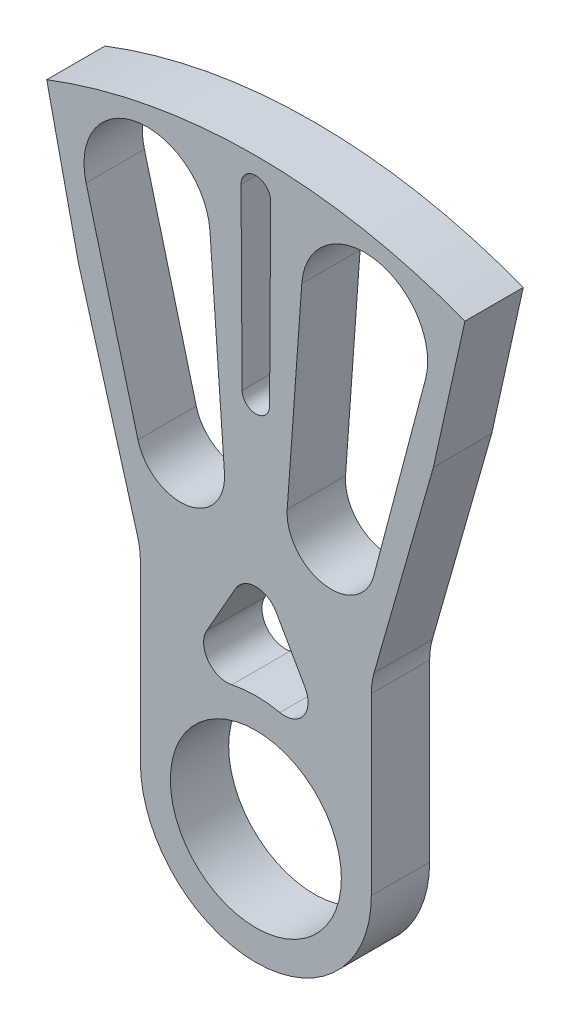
ISO-10303-21;
HEADER;
FILE_DESCRIPTION(('STEP AP214'),'2;1');
FILE_NAME('part.step','',(''),(''),'','','');
FILE_SCHEMA(('AUTOMOTIVE_DESIGN { 1 0 10303 214 1 1 1 1 }'));
ENDSEC;
DATA;
#1=APPLICATION_CONTEXT('core data for automotive mechanical design processes');
#2=APPLICATION_PROTOCOL_DEFINITION('international standard','automotive_design',2000,#1);
#3=PRODUCT_CONTEXT('',#1,'mechanical');
#4=PRODUCT('Part','Part','',(#3));
#5=PRODUCT_RELATED_PRODUCT_CATEGORY('part','',(#4));
#6=PRODUCT_DEFINITION_FORMATION('','',#4);
#7=PRODUCT_DEFINITION_CONTEXT('part definition',#1,'design');
#8=PRODUCT_DEFINITION('design','',#6,#7);
#9=PRODUCT_DEFINITION_SHAPE('','',#8);
#10=(LENGTH_UNIT() NAMED_UNIT(*) SI_UNIT(.MILLI.,.METRE.));
#11=(NAMED_UNIT(*) PLANE_ANGLE_UNIT() SI_UNIT($,.RADIAN.));
#12=(NAMED_UNIT(*) SI_UNIT($,.STERADIAN.) SOLID_ANGLE_UNIT());
#13=UNCERTAINTY_MEASURE_WITH_UNIT(LENGTH_MEASURE(1.E-05),#10,'distance_accuracy_value','');
#14=(GEOMETRIC_REPRESENTATION_CONTEXT(3) GLOBAL_UNCERTAINTY_ASSIGNED_CONTEXT((#13)) GLOBAL_UNIT_ASSIGNED_CONTEXT((#10,
#11,#12)) REPRESENTATION_CONTEXT('',''));
#15=CARTESIAN_POINT('',(0.,0.,0.));
#16=DIRECTION('',(0.,0.,1.));
#17=DIRECTION('',(1.,0.,0.));
#18=AXIS2_PLACEMENT_3D('',#15,#16,#17);
#19=CARTESIAN_POINT('',(0.,0.,-3.175));
#20=DIRECTION('',(0.,0.,1.));
#21=DIRECTION('',(1.,0.,0.));
#22=AXIS2_PLACEMENT_3D('',#19,#20,#21);
#23=PLANE('',#22);
#24=CARTESIAN_POINT('',(8.19902896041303,31.5104751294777,-3.175));
#25=DIRECTION('',(0.,0.,1.));
#26=DIRECTION('',(1.,0.,0.));
#27=AXIS2_PLACEMENT_3D('',#24,#25,#26);
#28=CIRCLE('',#27,4.79599679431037);
#29=CARTESIAN_POINT('',(6.06143658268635,27.217191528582,-3.175));
#30=VERTEX_POINT('',#29);
#31=CARTESIAN_POINT('',(12.8362883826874,30.2867879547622,-3.175));
#32=VERTEX_POINT('',#31);
#33=EDGE_CURVE('E11',#30,#32,#28,.T.);
#34=ORIENTED_EDGE('',*,*,#33,.T.);
#35=DIRECTION('',(0.255147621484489,0.966902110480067,0.));
#36=VECTOR('',#35,1.);
#37=CARTESIAN_POINT('',(18.4823558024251,51.6830074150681,-3.175));
#38=LINE('',#37,#36);
#39=CARTESIAN_POINT('',(14.4922875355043,36.5623278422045,-3.175));
#40=VERTEX_POINT('',#39);
#41=EDGE_CURVE('E370',#32,#40,#38,.T.);
#42=ORIENTED_EDGE('',*,*,#41,.T.);
#43=CARTESIAN_POINT('',(9.64692436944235,32.4580671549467,-3.175));
#44=DIRECTION('',(0.,0.,1.));
#45=DIRECTION('',(1.,0.,0.));
#46=AXIS2_PLACEMENT_3D('',#43,#44,#45);
#47=CIRCLE('',#46,6.35);
#48=CARTESIAN_POINT('',(15.9844545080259,32.060308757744,-3.175));
#49=VERTEX_POINT('',#48);
#50=EDGE_CURVE('E477',#40,#49,#47,.F.);
#51=ORIENTED_EDGE('',*,*,#50,.T.);
#52=DIRECTION('',(-0.27465134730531,-0.961543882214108,0.));
#53=VECTOR('',#52,1.);
#54=CARTESIAN_POINT('',(12.8660356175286,21.1428432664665,-3.175));
#55=LINE('',#54,#53);
#56=CARTESIAN_POINT('',(15.2384195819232,29.4484689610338,-3.175));
#57=VERTEX_POINT('',#56);
#58=EDGE_CURVE('E420',#49,#57,#55,.T.);
#59=ORIENTED_EDGE('',*,*,#58,.T.);
#60=EDGE_CURVE('E478',#57,#30,#47,.F.);
#61=ORIENTED_EDGE('',*,*,#60,.T.);
#62=EDGE_LOOP('',(#34,#42,#51,#59,#61));
#63=FACE_BOUND('',#62,.T.);
#64=ADVANCED_FACE('F38',(#63),#23,.F.);
#65=CARTESIAN_POINT('',(0.,0.,-3.175));
#66=DIRECTION('',(0.,0.,-1.));
#67=DIRECTION('',(1.,0.,0.));
#68=AXIS2_PLACEMENT_3D('',#65,#66,#67);
#69=CIRCLE('',#68,12.5730000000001);
#70=CARTESIAN_POINT('',(-2.61578959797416,12.2978849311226,-3.175));
#71=VERTEX_POINT('',#70);
#72=CARTESIAN_POINT('',(2.61578959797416,12.2978849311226,-3.175));
#73=VERTEX_POINT('',#72);
#74=EDGE_CURVE('E249',#71,#73,#69,.T.);
#75=ORIENTED_EDGE('',*,*,#74,.T.);
#76=CARTESIAN_POINT('',(3.14423194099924,14.7823061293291,-3.175));
#77=DIRECTION('',(0.,0.,1.));
#78=DIRECTION('',(-1.,0.,0.));
#79=AXIS2_PLACEMENT_3D('',#76,#77,#78);
#80=CIRCLE('',#79,2.54);
#81=CARTESIAN_POINT('',(5.35302583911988,16.0364311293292,-3.175));
#82=VERTEX_POINT('',#81);
#83=EDGE_CURVE('E243',#73,#82,#80,.T.);
#84=ORIENTED_EDGE('',*,*,#83,.T.);
#85=DIRECTION('',(-0.493750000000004,0.86960389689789,0.));
#86=VECTOR('',#85,1.);
#87=CARTESIAN_POINT('',(2.20879389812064,21.574125,-3.175));
#88=LINE('',#87,#86);
#89=CARTESIAN_POINT('',(2.20879389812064,21.574125,-3.175));
#90=VERTEX_POINT('',#89);
#91=EDGE_CURVE('E252',#82,#90,#88,.T.);
#92=ORIENTED_EDGE('',*,*,#91,.T.);
#93=CARTESIAN_POINT('',(0.,20.32,-3.175));
#94=DIRECTION('',(0.,0.,1.));
#95=DIRECTION('',(-1.,0.,0.));
#96=AXIS2_PLACEMENT_3D('',#93,#94,#95);
#97=CIRCLE('',#96,2.54);
#98=CARTESIAN_POINT('',(-2.20879389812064,21.574125,-3.175));
#99=VERTEX_POINT('',#98);
#100=EDGE_CURVE('E53',#90,#99,#97,.T.);
#101=ORIENTED_EDGE('',*,*,#100,.T.);
#102=DIRECTION('',(-0.493750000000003,-0.86960389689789,0.));
#103=VECTOR('',#102,1.);
#104=CARTESIAN_POINT('',(-5.35302583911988,16.0364311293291,-3.175));
#105=LINE('',#104,#103);
#106=CARTESIAN_POINT('',(-5.35302583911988,16.0364311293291,-3.175));
#107=VERTEX_POINT('',#106);
#108=EDGE_CURVE('E267',#99,#107,#105,.T.);
#109=ORIENTED_EDGE('',*,*,#108,.T.);
#110=CARTESIAN_POINT('',(-3.14423194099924,14.7823061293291,-3.175));
#111=DIRECTION('',(0.,0.,1.));
#112=DIRECTION('',(1.,0.,0.));
#113=AXIS2_PLACEMENT_3D('',#110,#111,#112);
#114=CIRCLE('',#113,2.54);
#115=EDGE_CURVE('E270',#107,#71,#114,.T.);
#116=ORIENTED_EDGE('',*,*,#115,.T.);
#117=EDGE_LOOP('',(#75,#84,#92,#101,#109,#116));
#118=FACE_BOUND('',#117,.T.);
#119=DIRECTION('',(0.00604847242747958,-0.999981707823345,0.));
#120=VECTOR('',#119,1.);
#121=CARTESIAN_POINT('',(-1.49582820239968,40.6309523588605,-3.175));
#122=LINE('',#121,#120);
#123=CARTESIAN_POINT('',(-1.61296925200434,59.9976450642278,-3.175));
#124=VERTEX_POINT('',#123);
#125=CARTESIAN_POINT('',(-1.49582820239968,40.6309523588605,-3.175));
#126=VERTEX_POINT('',#125);
#127=EDGE_CURVE('E304',#124,#126,#122,.T.);
#128=ORIENTED_EDGE('',*,*,#127,.T.);
#129=CARTESIAN_POINT('',(0.,40.64,-3.175));
#130=DIRECTION('',(0.,0.,1.));
#131=DIRECTION('',(1.,0.,0.));
#132=AXIS2_PLACEMENT_3D('',#129,#130,#131);
#133=CIRCLE('',#132,1.49585556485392);
#134=CARTESIAN_POINT('',(1.49582820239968,40.6309523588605,-3.175));
#135=VERTEX_POINT('',#134);
#136=EDGE_CURVE('E294',#126,#135,#133,.T.);
#137=ORIENTED_EDGE('',*,*,#136,.T.);
#138=DIRECTION('',(0.00604847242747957,0.999981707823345,0.));
#139=VECTOR('',#138,1.);
#140=CARTESIAN_POINT('',(1.49582820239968,40.6309523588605,-3.175));
#141=LINE('',#140,#139);
#142=CARTESIAN_POINT('',(1.61296925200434,59.9976450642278,-3.175));
#143=VERTEX_POINT('',#142);
#144=EDGE_CURVE('E297',#135,#143,#141,.T.);
#145=ORIENTED_EDGE('',*,*,#144,.T.);
#146=CARTESIAN_POINT('',(0.,60.0074012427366,-3.175));
#147=DIRECTION('',(0.,0.,1.));
#148=DIRECTION('',(1.,0.,0.));
#149=AXIS2_PLACEMENT_3D('',#146,#147,#148);
#150=CIRCLE('',#149,1.61299875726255);
#151=EDGE_CURVE('E301',#143,#124,#150,.T.);
#152=ORIENTED_EDGE('',*,*,#151,.T.);
#153=EDGE_LOOP('',(#128,#137,#145,#152));
#154=FACE_BOUND('',#153,.T.);
#155=DIRECTION('',(0.255147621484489,-0.966902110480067,0.));
#156=VECTOR('',#155,1.);
#157=CARTESIAN_POINT('',(-18.4823558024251,51.6830074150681,-3.175));
#158=LINE('',#157,#156);
#159=CARTESIAN_POINT('',(-18.4823558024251,51.6830074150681,-3.175));
#160=VERTEX_POINT('',#159);
#161=CARTESIAN_POINT('',(-12.8362883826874,30.2867879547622,-3.175));
#162=VERTEX_POINT('',#161);
#163=EDGE_CURVE('E336',#160,#162,#158,.T.);
#164=ORIENTED_EDGE('',*,*,#163,.T.);
#165=CARTESIAN_POINT('',(-8.19902896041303,31.5104751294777,-3.175));
#166=DIRECTION('',(0.,0.,1.));
#167=DIRECTION('',(1.,0.,0.));
#168=AXIS2_PLACEMENT_3D('',#165,#166,#167);
#169=CIRCLE('',#168,4.79599679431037);
#170=CARTESIAN_POINT('',(-3.41534921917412,31.8539767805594,-3.175));
#171=VERTEX_POINT('',#170);
#172=EDGE_CURVE('E326',#162,#171,#169,.T.);
#173=ORIENTED_EDGE('',*,*,#172,.T.);
#174=DIRECTION('',(-0.0716225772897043,0.997431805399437,0.));
#175=VECTOR('',#174,1.);
#176=CARTESIAN_POINT('',(-5.00025876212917,53.9257765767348,-3.175));
#177=LINE('',#176,#175);
#178=CARTESIAN_POINT('',(-5.00025876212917,53.9257765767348,-3.175));
#179=VERTEX_POINT('',#178);
#180=EDGE_CURVE('E329',#171,#179,#177,.T.);
#181=ORIENTED_EDGE('',*,*,#180,.T.);
#182=CARTESIAN_POINT('',(-11.8460767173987,53.4341989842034,-3.175));
#183=DIRECTION('',(0.,0.,1.));
#184=DIRECTION('',(1.,0.,0.));
#185=AXIS2_PLACEMENT_3D('',#182,#183,#184);
#186=CIRCLE('',#185,6.86344461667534);
#187=EDGE_CURVE('E333',#179,#160,#186,.T.);
#188=ORIENTED_EDGE('',*,*,#187,.T.);
#189=EDGE_LOOP('',(#164,#173,#181,#188));
#190=FACE_BOUND('',#189,.T.);
#191=CARTESIAN_POINT('',(3.4090677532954,31.2699405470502,-3.175));
#192=VERTEX_POINT('',#191);
#193=CARTESIAN_POINT('',(3.5973103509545,34.3880076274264,-3.175));
#194=VERTEX_POINT('',#193);
#195=EDGE_CURVE('E481',#192,#194,#47,.F.);
#196=ORIENTED_EDGE('',*,*,#195,.F.);
#197=CARTESIAN_POINT('',(8.19902896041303,31.5104751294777,-3.175));
#198=DIRECTION('',(0.,0.,1.));
#199=DIRECTION('',(1.,0.,0.));
#200=AXIS2_PLACEMENT_3D('',#197,#198,#199);
#201=CIRCLE('',#200,4.79599679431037);
#202=EDGE_CURVE('E365',#192,#30,#201,.T.);
#203=ORIENTED_EDGE('',*,*,#202,.T.);
#204=ORIENTED_EDGE('',*,*,#60,.F.);
#205=CARTESIAN_POINT('',(12.8660356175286,21.1428432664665,-3.175));
#206=VERTEX_POINT('',#205);
#207=EDGE_CURVE('E414',#57,#206,#55,.T.);
#208=ORIENTED_EDGE('',*,*,#207,.T.);
#209=CARTESIAN_POINT('',(20.1930000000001,19.05,-3.175));
#210=DIRECTION('',(0.,0.,1.));
#211=DIRECTION('',(1.,0.,0.));
#212=AXIS2_PLACEMENT_3D('',#209,#210,#211);
#213=CIRCLE('',#212,7.62);
#214=CARTESIAN_POINT('',(12.5730000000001,19.05,-3.175));
#215=VERTEX_POINT('',#214);
#216=EDGE_CURVE('E411',#206,#215,#213,.T.);
#217=ORIENTED_EDGE('',*,*,#216,.T.);
#218=DIRECTION('',(0.,1.,0.));
#219=VECTOR('',#218,1.);
#220=CARTESIAN_POINT('',(12.5730000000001,13.2922511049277,-3.175));
#221=LINE('',#220,#219);
#222=CARTESIAN_POINT('',(12.5730000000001,0.,-3.175));
#223=VERTEX_POINT('',#222);
#224=EDGE_CURVE('E456',#223,#215,#221,.T.);
#225=ORIENTED_EDGE('',*,*,#224,.F.);
#226=CARTESIAN_POINT('',(0.,0.,-3.175));
#227=DIRECTION('',(0.,0.,1.));
#228=DIRECTION('',(1.,0.,0.));
#229=AXIS2_PLACEMENT_3D('',#226,#227,#228);
#230=CIRCLE('',#229,12.5730000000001);
#231=CARTESIAN_POINT('',(-12.573,0.,-3.175));
#232=VERTEX_POINT('',#231);
#233=EDGE_CURVE('E437',#232,#223,#230,.T.);
#234=ORIENTED_EDGE('',*,*,#233,.F.);
#235=DIRECTION('',(0.,-1.,0.));
#236=VECTOR('',#235,1.);
#237=CARTESIAN_POINT('',(-12.5730000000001,13.2922511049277,-3.175));
#238=LINE('',#237,#236);
#239=CARTESIAN_POINT('',(-12.5730000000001,19.05,-3.175));
#240=VERTEX_POINT('',#239);
#241=EDGE_CURVE('E442',#240,#232,#238,.T.);
#242=ORIENTED_EDGE('',*,*,#241,.F.);
#243=CARTESIAN_POINT('',(-20.1930000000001,19.05,-3.175));
#244=DIRECTION('',(0.,0.,1.));
#245=DIRECTION('',(-1.,0.,0.));
#246=AXIS2_PLACEMENT_3D('',#243,#244,#245);
#247=CIRCLE('',#246,7.62);
#248=CARTESIAN_POINT('',(-12.8660356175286,21.1428432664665,-3.175));
#249=VERTEX_POINT('',#248);
#250=EDGE_CURVE('E392',#240,#249,#247,.T.);
#251=ORIENTED_EDGE('',*,*,#250,.T.);
#252=DIRECTION('',(-0.27465134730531,0.961543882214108,0.));
#253=VECTOR('',#252,1.);
#254=CARTESIAN_POINT('',(-12.8660356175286,21.1428432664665,-3.175));
#255=LINE('',#254,#253);
#256=CARTESIAN_POINT('',(-19.3318097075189,43.7792715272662,-3.175));
#257=VERTEX_POINT('',#256);
#258=EDGE_CURVE('E395',#249,#257,#255,.T.);
#259=ORIENTED_EDGE('',*,*,#258,.T.);
#260=DIRECTION('',(0.216439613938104,-0.976296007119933,0.));
#261=VECTOR('',#260,1.);
#262=CARTESIAN_POINT('',(-22.7677885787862,59.2779706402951,-3.175));
#263=LINE('',#262,#261);
#264=CARTESIAN_POINT('',(-22.7677885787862,59.2779706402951,-3.175));
#265=VERTEX_POINT('',#264);
#266=EDGE_CURVE('E462',#265,#257,#263,.T.);
#267=ORIENTED_EDGE('',*,*,#266,.F.);
#268=CARTESIAN_POINT('',(0.,0.,-3.175));
#269=DIRECTION('',(0.,0.,1.));
#270=DIRECTION('',(1.,0.,0.));
#271=AXIS2_PLACEMENT_3D('',#268,#269,#270);
#272=CIRCLE('',#271,63.5);
#273=CARTESIAN_POINT('',(22.7677885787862,59.2779706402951,-3.175));
#274=VERTEX_POINT('',#273);
#275=EDGE_CURVE('E460',#274,#265,#272,.T.);
#276=ORIENTED_EDGE('',*,*,#275,.F.);
#277=DIRECTION('',(0.216439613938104,0.976296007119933,0.));
#278=VECTOR('',#277,1.);
#279=CARTESIAN_POINT('',(22.7677885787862,59.2779706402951,-3.175));
#280=LINE('',#279,#278);
#281=CARTESIAN_POINT('',(19.3318097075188,43.7792715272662,-3.175));
#282=VERTEX_POINT('',#281);
#283=EDGE_CURVE('E458',#282,#274,#280,.T.);
#284=ORIENTED_EDGE('',*,*,#283,.F.);
#285=EDGE_CURVE('E416',#282,#49,#55,.T.);
#286=ORIENTED_EDGE('',*,*,#285,.T.);
#287=ORIENTED_EDGE('',*,*,#50,.F.);
#288=CARTESIAN_POINT('',(18.4823558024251,51.6830074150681,-3.175));
#289=VERTEX_POINT('',#288);
#290=EDGE_CURVE('E369',#40,#289,#38,.T.);
#291=ORIENTED_EDGE('',*,*,#290,.T.);
#292=CARTESIAN_POINT('',(11.8460767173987,53.4341989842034,-3.175));
#293=DIRECTION('',(0.,0.,1.));
#294=DIRECTION('',(1.,0.,0.));
#295=AXIS2_PLACEMENT_3D('',#292,#293,#294);
#296=CIRCLE('',#295,6.86344461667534);
#297=CARTESIAN_POINT('',(5.00025876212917,53.9257765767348,-3.175));
#298=VERTEX_POINT('',#297);
#299=EDGE_CURVE('E358',#289,#298,#296,.T.);
#300=ORIENTED_EDGE('',*,*,#299,.T.);
#301=DIRECTION('',(-0.0716225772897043,-0.997431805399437,0.));
#302=VECTOR('',#301,1.);
#303=CARTESIAN_POINT('',(5.00025876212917,53.9257765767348,-3.175));
#304=LINE('',#303,#302);
#305=EDGE_CURVE('E361',#298,#194,#304,.T.);
#306=ORIENTED_EDGE('',*,*,#305,.T.);
#307=EDGE_LOOP('',(#196,#203,#204,#208,#217,#225,#234,#242,#251,#259,#267,#276,#284,#286,#287,
#291,#300,#306));
#308=FACE_BOUND('',#307,.T.);
#309=CARTESIAN_POINT('',(0.,0.,-3.175));
#310=DIRECTION('',(0.,0.,-1.));
#311=DIRECTION('',(-1.,0.,0.));
#312=AXIS2_PLACEMENT_3D('',#309,#310,#311);
#313=CIRCLE('',#312,9.3091);
#314=CARTESIAN_POINT('',(-9.3091,0.,-3.175));
#315=VERTEX_POINT('',#314);
#316=EDGE_CURVE('E427',#315,#315,#313,.T.);
#317=ORIENTED_EDGE('',*,*,#316,.F.);
#318=EDGE_LOOP('',(#317));
#319=FACE_BOUND('',#318,.T.);
#320=ADVANCED_FACE('F256',(#118,#154,#190,#308,#319),#23,.F.);
#321=CARTESIAN_POINT('',(0.,0.,3.175));
#322=DIRECTION('',(0.,0.,1.));
#323=DIRECTION('',(1.,0.,0.));
#324=AXIS2_PLACEMENT_3D('',#321,#322,#323);
#325=PLANE('',#324);
#326=CARTESIAN_POINT('',(3.14423194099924,14.7823061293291,3.175));
#327=DIRECTION('',(0.,0.,1.));
#328=DIRECTION('',(-1.,0.,0.));
#329=AXIS2_PLACEMENT_3D('',#326,#327,#328);
#330=CIRCLE('',#329,2.54);
#331=CARTESIAN_POINT('',(2.61578959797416,12.2978849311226,3.175));
#332=VERTEX_POINT('',#331);
#333=CARTESIAN_POINT('',(5.35302583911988,16.0364311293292,3.175));
#334=VERTEX_POINT('',#333);
#335=EDGE_CURVE('E61',#332,#334,#330,.T.);
#336=ORIENTED_EDGE('',*,*,#335,.F.);
#337=CARTESIAN_POINT('',(0.,0.,3.175));
#338=DIRECTION('',(0.,0.,-1.));
#339=DIRECTION('',(1.,0.,0.));
#340=AXIS2_PLACEMENT_3D('',#337,#338,#339);
#341=CIRCLE('',#340,12.5730000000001);
#342=CARTESIAN_POINT('',(-2.61578959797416,12.2978849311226,3.175));
#343=VERTEX_POINT('',#342);
#344=EDGE_CURVE('E260',#343,#332,#341,.T.);
#345=ORIENTED_EDGE('',*,*,#344,.F.);
#346=CARTESIAN_POINT('',(-3.14423194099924,14.7823061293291,3.175));
#347=DIRECTION('',(0.,0.,1.));
#348=DIRECTION('',(1.,0.,0.));
#349=AXIS2_PLACEMENT_3D('',#346,#347,#348);
#350=CIRCLE('',#349,2.54);
#351=CARTESIAN_POINT('',(-5.35302583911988,16.0364311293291,3.175));
#352=VERTEX_POINT('',#351);
#353=EDGE_CURVE('E263',#352,#343,#350,.T.);
#354=ORIENTED_EDGE('',*,*,#353,.F.);
#355=DIRECTION('',(-0.493750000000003,-0.86960389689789,0.));
#356=VECTOR('',#355,1.);
#357=CARTESIAN_POINT('',(-5.35302583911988,16.0364311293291,3.175));
#358=LINE('',#357,#356);
#359=CARTESIAN_POINT('',(-2.20879389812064,21.574125,3.175));
#360=VERTEX_POINT('',#359);
#361=EDGE_CURVE('E279',#360,#352,#358,.T.);
#362=ORIENTED_EDGE('',*,*,#361,.F.);
#363=CARTESIAN_POINT('',(0.,20.32,3.175));
#364=DIRECTION('',(0.,0.,1.));
#365=DIRECTION('',(-1.,0.,0.));
#366=AXIS2_PLACEMENT_3D('',#363,#364,#365);
#367=CIRCLE('',#366,2.54);
#368=CARTESIAN_POINT('',(2.20879389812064,21.574125,3.175));
#369=VERTEX_POINT('',#368);
#370=EDGE_CURVE('E276',#369,#360,#367,.T.);
#371=ORIENTED_EDGE('',*,*,#370,.F.);
#372=DIRECTION('',(-0.493750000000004,0.86960389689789,0.));
#373=VECTOR('',#372,1.);
#374=CARTESIAN_POINT('',(2.20879389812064,21.574125,3.175));
#375=LINE('',#374,#373);
#376=EDGE_CURVE('E274',#334,#369,#375,.T.);
#377=ORIENTED_EDGE('',*,*,#376,.F.);
#378=EDGE_LOOP('',(#336,#345,#354,#362,#371,#377));
#379=FACE_BOUND('',#378,.T.);
#380=CARTESIAN_POINT('',(0.,40.64,3.175));
#381=DIRECTION('',(0.,0.,1.));
#382=DIRECTION('',(1.,0.,0.));
#383=AXIS2_PLACEMENT_3D('',#380,#381,#382);
#384=CIRCLE('',#383,1.49585556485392);
#385=CARTESIAN_POINT('',(-1.49582820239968,40.6309523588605,3.175));
#386=VERTEX_POINT('',#385);
#387=CARTESIAN_POINT('',(1.49582820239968,40.6309523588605,3.175));
#388=VERTEX_POINT('',#387);
#389=EDGE_CURVE('E286',#386,#388,#384,.T.);
#390=ORIENTED_EDGE('',*,*,#389,.F.);
#391=DIRECTION('',(0.00604847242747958,-0.999981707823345,0.));
#392=VECTOR('',#391,1.);
#393=CARTESIAN_POINT('',(-1.49582820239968,40.6309523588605,3.175));
#394=LINE('',#393,#392);
#395=CARTESIAN_POINT('',(-1.61296925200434,59.9976450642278,3.175));
#396=VERTEX_POINT('',#395);
#397=EDGE_CURVE('E298',#396,#386,#394,.T.);
#398=ORIENTED_EDGE('',*,*,#397,.F.);
#399=CARTESIAN_POINT('',(0.,60.0074012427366,3.175));
#400=DIRECTION('',(0.,0.,1.));
#401=DIRECTION('',(1.,0.,0.));
#402=AXIS2_PLACEMENT_3D('',#399,#400,#401);
#403=CIRCLE('',#402,1.61299875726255);
#404=CARTESIAN_POINT('',(1.61296925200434,59.9976450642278,3.175));
#405=VERTEX_POINT('',#404);
#406=EDGE_CURVE('E312',#405,#396,#403,.T.);
#407=ORIENTED_EDGE('',*,*,#406,.F.);
#408=DIRECTION('',(0.00604847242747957,0.999981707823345,0.));
#409=VECTOR('',#408,1.);
#410=CARTESIAN_POINT('',(1.49582820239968,40.6309523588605,3.175));
#411=LINE('',#410,#409);
#412=EDGE_CURVE('E309',#388,#405,#411,.T.);
#413=ORIENTED_EDGE('',*,*,#412,.F.);
#414=EDGE_LOOP('',(#390,#398,#407,#413));
#415=FACE_BOUND('',#414,.T.);
#416=CARTESIAN_POINT('',(-8.19902896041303,31.5104751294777,3.175));
#417=DIRECTION('',(0.,0.,1.));
#418=DIRECTION('',(1.,0.,0.));
#419=AXIS2_PLACEMENT_3D('',#416,#417,#418);
#420=CIRCLE('',#419,4.79599679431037);
#421=CARTESIAN_POINT('',(-12.8362883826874,30.2867879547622,3.175));
#422=VERTEX_POINT('',#421);
#423=CARTESIAN_POINT('',(-3.41534921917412,31.8539767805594,3.175));
#424=VERTEX_POINT('',#423);
#425=EDGE_CURVE('E319',#422,#424,#420,.T.);
#426=ORIENTED_EDGE('',*,*,#425,.F.);
#427=DIRECTION('',(0.255147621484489,-0.966902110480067,0.));
#428=VECTOR('',#427,1.);
#429=CARTESIAN_POINT('',(-18.4823558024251,51.6830074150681,3.175));
#430=LINE('',#429,#428);
#431=CARTESIAN_POINT('',(-18.4823558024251,51.6830074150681,3.175));
#432=VERTEX_POINT('',#431);
#433=EDGE_CURVE('E330',#432,#422,#430,.T.);
#434=ORIENTED_EDGE('',*,*,#433,.F.);
#435=CARTESIAN_POINT('',(-11.8460767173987,53.4341989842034,3.175));
#436=DIRECTION('',(0.,0.,1.));
#437=DIRECTION('',(1.,0.,0.));
#438=AXIS2_PLACEMENT_3D('',#435,#436,#437);
#439=CIRCLE('',#438,6.86344461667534);
#440=CARTESIAN_POINT('',(-5.00025876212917,53.9257765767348,3.175));
#441=VERTEX_POINT('',#440);
#442=EDGE_CURVE('E344',#441,#432,#439,.T.);
#443=ORIENTED_EDGE('',*,*,#442,.F.);
#444=DIRECTION('',(-0.0716225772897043,0.997431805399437,0.));
#445=VECTOR('',#444,1.);
#446=CARTESIAN_POINT('',(-5.00025876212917,53.9257765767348,3.175));
#447=LINE('',#446,#445);
#448=EDGE_CURVE('E341',#424,#441,#447,.T.);
#449=ORIENTED_EDGE('',*,*,#448,.F.);
#450=EDGE_LOOP('',(#426,#434,#443,#449));
#451=FACE_BOUND('',#450,.T.);
#452=CARTESIAN_POINT('',(11.8460767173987,53.4341989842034,3.175));
#453=DIRECTION('',(0.,0.,1.));
#454=DIRECTION('',(1.,0.,0.));
#455=AXIS2_PLACEMENT_3D('',#452,#453,#454);
#456=CIRCLE('',#455,6.86344461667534);
#457=CARTESIAN_POINT('',(18.4823558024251,51.6830074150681,3.175));
#458=VERTEX_POINT('',#457);
#459=CARTESIAN_POINT('',(5.00025876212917,53.9257765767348,3.175));
#460=VERTEX_POINT('',#459);
#461=EDGE_CURVE('E351',#458,#460,#456,.T.);
#462=ORIENTED_EDGE('',*,*,#461,.F.);
#463=DIRECTION('',(0.255147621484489,0.966902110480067,0.));
#464=VECTOR('',#463,1.);
#465=CARTESIAN_POINT('',(18.4823558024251,51.6830074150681,3.175));
#466=LINE('',#465,#464);
#467=CARTESIAN_POINT('',(12.8362883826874,30.2867879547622,3.175));
#468=VERTEX_POINT('',#467);
#469=EDGE_CURVE('E362',#468,#458,#466,.T.);
#470=ORIENTED_EDGE('',*,*,#469,.F.);
#471=CARTESIAN_POINT('',(8.19902896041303,31.5104751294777,3.175));
#472=DIRECTION('',(0.,0.,1.));
#473=DIRECTION('',(1.,0.,0.));
#474=AXIS2_PLACEMENT_3D('',#471,#472,#473);
#475=CIRCLE('',#474,4.79599679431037);
#476=CARTESIAN_POINT('',(3.41534921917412,31.8539767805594,3.175));
#477=VERTEX_POINT('',#476);
#478=EDGE_CURVE('E378',#477,#468,#475,.T.);
#479=ORIENTED_EDGE('',*,*,#478,.F.);
#480=DIRECTION('',(-0.0716225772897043,-0.997431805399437,0.));
#481=VECTOR('',#480,1.);
#482=CARTESIAN_POINT('',(5.00025876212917,53.9257765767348,3.175));
#483=LINE('',#482,#481);
#484=EDGE_CURVE('E375',#460,#477,#483,.T.);
#485=ORIENTED_EDGE('',*,*,#484,.F.);
#486=EDGE_LOOP('',(#462,#470,#479,#485));
#487=FACE_BOUND('',#486,.T.);
#488=CARTESIAN_POINT('',(-20.1930000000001,19.05,3.175));
#489=DIRECTION('',(0.,0.,1.));
#490=DIRECTION('',(-1.,0.,0.));
#491=AXIS2_PLACEMENT_3D('',#488,#489,#490);
#492=CIRCLE('',#491,7.62);
#493=CARTESIAN_POINT('',(-12.5730000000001,19.05,3.175));
#494=VERTEX_POINT('',#493);
#495=CARTESIAN_POINT('',(-12.8660356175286,21.1428432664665,3.175));
#496=VERTEX_POINT('',#495);
#497=EDGE_CURVE('E385',#494,#496,#492,.T.);
#498=ORIENTED_EDGE('',*,*,#497,.F.);
#499=DIRECTION('',(0.,-1.,0.));
#500=VECTOR('',#499,1.);
#501=CARTESIAN_POINT('',(-12.5730000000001,13.2922511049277,3.175));
#502=LINE('',#501,#500);
#503=CARTESIAN_POINT('',(-12.573,0.,3.175));
#504=VERTEX_POINT('',#503);
#505=EDGE_CURVE('E451',#494,#504,#502,.T.);
#506=ORIENTED_EDGE('',*,*,#505,.T.);
#507=CARTESIAN_POINT('',(0.,0.,3.175));
#508=DIRECTION('',(0.,0.,1.));
#509=DIRECTION('',(1.,0.,0.));
#510=AXIS2_PLACEMENT_3D('',#507,#508,#509);
#511=CIRCLE('',#510,12.5730000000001);
#512=CARTESIAN_POINT('',(12.5730000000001,0.,3.175));
#513=VERTEX_POINT('',#512);
#514=EDGE_CURVE('E438',#504,#513,#511,.T.);
#515=ORIENTED_EDGE('',*,*,#514,.T.);
#516=DIRECTION('',(0.,1.,0.));
#517=VECTOR('',#516,1.);
#518=CARTESIAN_POINT('',(12.5730000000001,13.2922511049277,3.175));
#519=LINE('',#518,#517);
#520=CARTESIAN_POINT('',(12.5730000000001,19.05,3.175));
#521=VERTEX_POINT('',#520);
#522=EDGE_CURVE('E441',#513,#521,#519,.T.);
#523=ORIENTED_EDGE('',*,*,#522,.T.);
#524=CARTESIAN_POINT('',(20.1930000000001,19.05,3.175));
#525=DIRECTION('',(0.,0.,1.));
#526=DIRECTION('',(1.,0.,0.));
#527=AXIS2_PLACEMENT_3D('',#524,#525,#526);
#528=CIRCLE('',#527,7.62);
#529=CARTESIAN_POINT('',(12.8660356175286,21.1428432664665,3.175));
#530=VERTEX_POINT('',#529);
#531=EDGE_CURVE('E406',#530,#521,#528,.T.);
#532=ORIENTED_EDGE('',*,*,#531,.F.);
#533=DIRECTION('',(-0.27465134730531,-0.961543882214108,0.));
#534=VECTOR('',#533,1.);
#535=CARTESIAN_POINT('',(12.8660356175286,21.1428432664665,3.175));
#536=LINE('',#535,#534);
#537=CARTESIAN_POINT('',(19.3318097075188,43.7792715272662,3.175));
#538=VERTEX_POINT('',#537);
#539=EDGE_CURVE('E415',#538,#530,#536,.T.);
#540=ORIENTED_EDGE('',*,*,#539,.F.);
#541=DIRECTION('',(0.216439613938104,0.976296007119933,0.));
#542=VECTOR('',#541,1.);
#543=CARTESIAN_POINT('',(22.7677885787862,59.2779706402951,3.175));
#544=LINE('',#543,#542);
#545=CARTESIAN_POINT('',(22.7677885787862,59.2779706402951,3.175));
#546=VERTEX_POINT('',#545);
#547=EDGE_CURVE('E444',#538,#546,#544,.T.);
#548=ORIENTED_EDGE('',*,*,#547,.T.);
#549=CARTESIAN_POINT('',(0.,0.,3.175));
#550=DIRECTION('',(0.,0.,1.));
#551=DIRECTION('',(1.,0.,0.));
#552=AXIS2_PLACEMENT_3D('',#549,#550,#551);
#553=CIRCLE('',#552,63.5);
#554=CARTESIAN_POINT('',(-22.7677885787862,59.2779706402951,3.175));
#555=VERTEX_POINT('',#554);
#556=EDGE_CURVE('E446',#546,#555,#553,.T.);
#557=ORIENTED_EDGE('',*,*,#556,.T.);
#558=DIRECTION('',(0.216439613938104,-0.976296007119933,0.));
#559=VECTOR('',#558,1.);
#560=CARTESIAN_POINT('',(-22.7677885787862,59.2779706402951,3.175));
#561=LINE('',#560,#559);
#562=CARTESIAN_POINT('',(-19.3318097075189,43.7792715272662,3.175));
#563=VERTEX_POINT('',#562);
#564=EDGE_CURVE('E448',#555,#563,#561,.T.);
#565=ORIENTED_EDGE('',*,*,#564,.T.);
#566=DIRECTION('',(-0.27465134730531,0.961543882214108,0.));
#567=VECTOR('',#566,1.);
#568=CARTESIAN_POINT('',(-12.8660356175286,21.1428432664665,3.175));
#569=LINE('',#568,#567);
#570=EDGE_CURVE('E396',#496,#563,#569,.T.);
#571=ORIENTED_EDGE('',*,*,#570,.F.);
#572=EDGE_LOOP('',(#498,#506,#515,#523,#532,#540,#548,#557,#565,#571));
#573=FACE_BOUND('',#572,.T.);
#574=CARTESIAN_POINT('',(0.,0.,3.175));
#575=DIRECTION('',(0.,0.,1.));
#576=DIRECTION('',(1.,0.,0.));
#577=AXIS2_PLACEMENT_3D('',#574,#575,#576);
#578=CIRCLE('',#577,9.3091);
#579=CARTESIAN_POINT('',(9.3091,0.,3.175));
#580=VERTEX_POINT('',#579);
#581=EDGE_CURVE('E434',#580,#580,#578,.F.);
#582=ORIENTED_EDGE('',*,*,#581,.T.);
#583=EDGE_LOOP('',(#582));
#584=FACE_BOUND('',#583,.T.);
#585=ADVANCED_FACE('F503',(#379,#415,#451,#487,#573,#584),#325,.T.);
#586=DIRECTION('',(-0.0716225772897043,-0.997431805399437,0.));
#587=VECTOR('',#586,1.);
#588=CARTESIAN_POINT('',(1.1222245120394,-0.08058356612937,-3.175));
#589=LINE('',#588,#587);
#590=CARTESIAN_POINT('',(3.41534921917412,31.8539767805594,-3.175));
#591=VERTEX_POINT('',#590);
#592=EDGE_CURVE('E46',#194,#591,#589,.T.);
#593=ORIENTED_EDGE('',*,*,#592,.T.);
#594=EDGE_CURVE('E366',#591,#192,#201,.T.);
#595=ORIENTED_EDGE('',*,*,#594,.T.);
#596=ORIENTED_EDGE('',*,*,#195,.T.);
#597=EDGE_LOOP('',(#593,#595,#596));
#598=FACE_BOUND('',#597,.T.);
#599=ADVANCED_FACE('F485',(#598),#23,.F.);
#600=CARTESIAN_POINT('',(0.,0.,3.175));
#601=DIRECTION('',(0.,0.,-1.));
#602=DIRECTION('',(-1.,0.,0.));
#603=AXIS2_PLACEMENT_3D('',#600,#601,#602);
#604=CYLINDRICAL_SURFACE('',#603,12.5730000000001);
#605=ORIENTED_EDGE('',*,*,#233,.T.);
#606=DIRECTION('',(0.,0.,-1.));
#607=VECTOR('',#606,1.);
#608=CARTESIAN_POINT('',(12.5730000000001,0.,3.175));
#609=LINE('',#608,#607);
#610=EDGE_CURVE('E474',#513,#223,#609,.T.);
#611=ORIENTED_EDGE('',*,*,#610,.F.);
#612=ORIENTED_EDGE('',*,*,#514,.F.);
#613=DIRECTION('',(0.,0.,-1.));
#614=VECTOR('',#613,1.);
#615=CARTESIAN_POINT('',(-12.573,0.,3.175));
#616=LINE('',#615,#614);
#617=EDGE_CURVE('E453',#504,#232,#616,.T.);
#618=ORIENTED_EDGE('',*,*,#617,.T.);
#619=EDGE_LOOP('',(#605,#611,#612,#618));
#620=FACE_BOUND('',#619,.T.);
#621=ADVANCED_FACE('F40',(#620),#604,.T.);
#622=CARTESIAN_POINT('',(12.5730000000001,13.2922511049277,3.175));
#623=DIRECTION('',(-1.,0.,0.));
#624=DIRECTION('',(0.,-1.,0.));
#625=AXIS2_PLACEMENT_3D('',#622,#623,#624);
#626=PLANE('',#625);
#627=ORIENTED_EDGE('',*,*,#224,.T.);
#628=DIRECTION('',(0.,0.,1.));
#629=VECTOR('',#628,1.);
#630=CARTESIAN_POINT('',(12.5730000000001,19.05,-3.175));
#631=LINE('',#630,#629);
#632=EDGE_CURVE('E419',#215,#521,#631,.T.);
#633=ORIENTED_EDGE('',*,*,#632,.T.);
#634=ORIENTED_EDGE('',*,*,#522,.F.);
#635=ORIENTED_EDGE('',*,*,#610,.T.);
#636=EDGE_LOOP('',(#627,#633,#634,#635));
#637=FACE_BOUND('',#636,.T.);
#638=ADVANCED_FACE('F523',(#637),#626,.F.);
#639=CARTESIAN_POINT('',(22.7677885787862,59.2779706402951,3.175));
#640=DIRECTION('',(-0.976296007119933,0.216439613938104,0.));
#641=DIRECTION('',(-0.216439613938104,-0.976296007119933,0.));
#642=AXIS2_PLACEMENT_3D('',#639,#640,#641);
#643=PLANE('',#642);
#644=ORIENTED_EDGE('',*,*,#547,.F.);
#645=DIRECTION('',(0.,0.,1.));
#646=VECTOR('',#645,1.);
#647=CARTESIAN_POINT('',(19.3318097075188,43.7792715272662,-3.175));
#648=LINE('',#647,#646);
#649=EDGE_CURVE('E428',#282,#538,#648,.T.);
#650=ORIENTED_EDGE('',*,*,#649,.F.);
#651=ORIENTED_EDGE('',*,*,#283,.T.);
#652=DIRECTION('',(0.,0.,-1.));
#653=VECTOR('',#652,1.);
#654=CARTESIAN_POINT('',(22.7677885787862,59.2779706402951,3.175));
#655=LINE('',#654,#653);
#656=EDGE_CURVE('E471',#546,#274,#655,.T.);
#657=ORIENTED_EDGE('',*,*,#656,.F.);
#658=EDGE_LOOP('',(#644,#650,#651,#657));
#659=FACE_BOUND('',#658,.T.);
#660=ADVANCED_FACE('F552',(#659),#643,.F.);
#661=CARTESIAN_POINT('',(0.,0.,3.175));
#662=DIRECTION('',(0.,0.,-1.));
#663=DIRECTION('',(-1.,0.,0.));
#664=AXIS2_PLACEMENT_3D('',#661,#662,#663);
#665=CYLINDRICAL_SURFACE('',#664,63.5);
#666=ORIENTED_EDGE('',*,*,#275,.T.);
#667=DIRECTION('',(0.,0.,-1.));
#668=VECTOR('',#667,1.);
#669=CARTESIAN_POINT('',(-22.7677885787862,59.2779706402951,3.175));
#670=LINE('',#669,#668);
#671=EDGE_CURVE('E468',#555,#265,#670,.T.);
#672=ORIENTED_EDGE('',*,*,#671,.F.);
#673=ORIENTED_EDGE('',*,*,#556,.F.);
#674=ORIENTED_EDGE('',*,*,#656,.T.);
#675=EDGE_LOOP('',(#666,#672,#673,#674));
#676=FACE_BOUND('',#675,.T.);
#677=ADVANCED_FACE('F546',(#676),#665,.T.);
#678=CARTESIAN_POINT('',(-22.7677885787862,59.2779706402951,3.175));
#679=DIRECTION('',(0.976296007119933,0.216439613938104,0.));
#680=DIRECTION('',(-0.216439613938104,0.976296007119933,0.));
#681=AXIS2_PLACEMENT_3D('',#678,#679,#680);
#682=PLANE('',#681);
#683=ORIENTED_EDGE('',*,*,#266,.T.);
#684=DIRECTION('',(0.,0.,1.));
#685=VECTOR('',#684,1.);
#686=CARTESIAN_POINT('',(-19.3318097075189,43.7792715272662,-3.175));
#687=LINE('',#686,#685);
#688=EDGE_CURVE('E407',#257,#563,#687,.T.);
#689=ORIENTED_EDGE('',*,*,#688,.T.);
#690=ORIENTED_EDGE('',*,*,#564,.F.);
#691=ORIENTED_EDGE('',*,*,#671,.T.);
#692=EDGE_LOOP('',(#683,#689,#690,#691));
#693=FACE_BOUND('',#692,.T.);
#694=ADVANCED_FACE('F541',(#693),#682,.F.);
#695=CARTESIAN_POINT('',(-12.5730000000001,13.2922511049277,3.175));
#696=DIRECTION('',(1.,0.,0.));
#697=DIRECTION('',(0.,1.,0.));
#698=AXIS2_PLACEMENT_3D('',#695,#696,#697);
#699=PLANE('',#698);
#700=ORIENTED_EDGE('',*,*,#241,.T.);
#701=ORIENTED_EDGE('',*,*,#617,.F.);
#702=ORIENTED_EDGE('',*,*,#505,.F.);
#703=DIRECTION('',(0.,0.,1.));
#704=VECTOR('',#703,1.);
#705=CARTESIAN_POINT('',(-12.5730000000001,19.05,-3.175));
#706=LINE('',#705,#704);
#707=EDGE_CURVE('E403',#240,#494,#706,.T.);
#708=ORIENTED_EDGE('',*,*,#707,.F.);
#709=EDGE_LOOP('',(#700,#701,#702,#708));
#710=FACE_BOUND('',#709,.T.);
#711=ADVANCED_FACE('F531',(#710),#699,.F.);
#712=CARTESIAN_POINT('',(0.,0.,29.756558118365));
#713=DIRECTION('',(0.,0.,-1.));
#714=DIRECTION('',(-1.,0.,0.));
#715=AXIS2_PLACEMENT_3D('',#712,#713,#714);
#716=CYLINDRICAL_SURFACE('',#715,9.3091);
#717=ORIENTED_EDGE('',*,*,#316,.T.);
#718=EDGE_LOOP('',(#717));
#719=FACE_BOUND('',#718,.T.);
#720=ORIENTED_EDGE('',*,*,#581,.F.);
#721=EDGE_LOOP('',(#720));
#722=FACE_BOUND('',#721,.T.);
#723=ADVANCED_FACE('F582',(#719,#722),#716,.F.);
#724=CARTESIAN_POINT('',(20.1930000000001,19.05,-3.175));
#725=DIRECTION('',(0.,0.,1.));
#726=DIRECTION('',(1.,0.,0.));
#727=AXIS2_PLACEMENT_3D('',#724,#725,#726);
#728=CYLINDRICAL_SURFACE('',#727,7.62);
#729=ORIENTED_EDGE('',*,*,#531,.T.);
#730=ORIENTED_EDGE('',*,*,#632,.F.);
#731=ORIENTED_EDGE('',*,*,#216,.F.);
#732=DIRECTION('',(0.,0.,1.));
#733=VECTOR('',#732,1.);
#734=CARTESIAN_POINT('',(12.8660356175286,21.1428432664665,-3.175));
#735=LINE('',#734,#733);
#736=EDGE_CURVE('E425',#206,#530,#735,.T.);
#737=ORIENTED_EDGE('',*,*,#736,.T.);
#738=EDGE_LOOP('',(#729,#730,#731,#737));
#739=FACE_BOUND('',#738,.T.);
#740=ADVANCED_FACE('F521',(#739),#728,.F.);
#741=CARTESIAN_POINT('',(12.8660356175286,21.1428432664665,-3.175));
#742=DIRECTION('',(-0.961543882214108,0.27465134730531,0.));
#743=DIRECTION('',(-0.27465134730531,-0.961543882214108,0.));
#744=AXIS2_PLACEMENT_3D('',#741,#742,#743);
#745=PLANE('',#744);
#746=ORIENTED_EDGE('',*,*,#539,.T.);
#747=ORIENTED_EDGE('',*,*,#736,.F.);
#748=ORIENTED_EDGE('',*,*,#207,.F.);
#749=ORIENTED_EDGE('',*,*,#58,.F.);
#750=ORIENTED_EDGE('',*,*,#285,.F.);
#751=ORIENTED_EDGE('',*,*,#649,.T.);
#752=EDGE_LOOP('',(#746,#747,#748,#749,#750,#751));
#753=FACE_BOUND('',#752,.T.);
#754=ADVANCED_FACE('F516',(#753),#745,.F.);
#755=CARTESIAN_POINT('',(-20.1930000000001,19.05,-3.175));
#756=DIRECTION('',(0.,0.,1.));
#757=DIRECTION('',(1.,0.,0.));
#758=AXIS2_PLACEMENT_3D('',#755,#756,#757);
#759=CYLINDRICAL_SURFACE('',#758,7.62);
#760=ORIENTED_EDGE('',*,*,#497,.T.);
#761=DIRECTION('',(0.,0.,1.));
#762=VECTOR('',#761,1.);
#763=CARTESIAN_POINT('',(-12.8660356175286,21.1428432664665,-3.175));
#764=LINE('',#763,#762);
#765=EDGE_CURVE('E399',#249,#496,#764,.T.);
#766=ORIENTED_EDGE('',*,*,#765,.F.);
#767=ORIENTED_EDGE('',*,*,#250,.F.);
#768=ORIENTED_EDGE('',*,*,#707,.T.);
#769=EDGE_LOOP('',(#760,#766,#767,#768));
#770=FACE_BOUND('',#769,.T.);
#771=ADVANCED_FACE('F535',(#770),#759,.F.);
#772=CARTESIAN_POINT('',(-12.8660356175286,21.1428432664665,-3.175));
#773=DIRECTION('',(0.961543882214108,0.27465134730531,0.));
#774=DIRECTION('',(-0.27465134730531,0.961543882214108,0.));
#775=AXIS2_PLACEMENT_3D('',#772,#773,#774);
#776=PLANE('',#775);
#777=ORIENTED_EDGE('',*,*,#570,.T.);
#778=ORIENTED_EDGE('',*,*,#688,.F.);
#779=ORIENTED_EDGE('',*,*,#258,.F.);
#780=ORIENTED_EDGE('',*,*,#765,.T.);
#781=EDGE_LOOP('',(#777,#778,#779,#780));
#782=FACE_BOUND('',#781,.T.);
#783=ADVANCED_FACE('F555',(#782),#776,.F.);
#784=CARTESIAN_POINT('',(11.8460767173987,53.4341989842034,-3.175));
#785=DIRECTION('',(0.,0.,1.));
#786=DIRECTION('',(1.,0.,0.));
#787=AXIS2_PLACEMENT_3D('',#784,#785,#786);
#788=CYLINDRICAL_SURFACE('',#787,6.86344461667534);
#789=ORIENTED_EDGE('',*,*,#461,.T.);
#790=DIRECTION('',(0.,0.,1.));
#791=VECTOR('',#790,1.);
#792=CARTESIAN_POINT('',(5.00025876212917,53.9257765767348,-3.175));
#793=LINE('',#792,#791);
#794=EDGE_CURVE('E373',#298,#460,#793,.T.);
#795=ORIENTED_EDGE('',*,*,#794,.F.);
#796=ORIENTED_EDGE('',*,*,#299,.F.);
#797=DIRECTION('',(0.,0.,1.));
#798=VECTOR('',#797,1.);
#799=CARTESIAN_POINT('',(18.4823558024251,51.6830074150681,-3.175));
#800=LINE('',#799,#798);
#801=EDGE_CURVE('E383',#289,#458,#800,.T.);
#802=ORIENTED_EDGE('',*,*,#801,.T.);
#803=EDGE_LOOP('',(#789,#795,#796,#802));
#804=FACE_BOUND('',#803,.T.);
#805=ADVANCED_FACE('F498',(#804),#788,.F.);
#806=CARTESIAN_POINT('',(18.4823558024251,51.6830074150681,-3.175));
#807=DIRECTION('',(0.966902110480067,-0.255147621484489,0.));
#808=DIRECTION('',(0.255147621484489,0.966902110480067,0.));
#809=AXIS2_PLACEMENT_3D('',#806,#807,#808);
#810=PLANE('',#809);
#811=ORIENTED_EDGE('',*,*,#469,.T.);
#812=ORIENTED_EDGE('',*,*,#801,.F.);
#813=ORIENTED_EDGE('',*,*,#290,.F.);
#814=ORIENTED_EDGE('',*,*,#41,.F.);
#815=DIRECTION('',(0.,0.,1.));
#816=VECTOR('',#815,1.);
#817=CARTESIAN_POINT('',(12.8362883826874,30.2867879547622,-3.175));
#818=LINE('',#817,#816);
#819=EDGE_CURVE('E386',#32,#468,#818,.T.);
#820=ORIENTED_EDGE('',*,*,#819,.T.);
#821=EDGE_LOOP('',(#811,#812,#813,#814,#820));
#822=FACE_BOUND('',#821,.T.);
#823=ADVANCED_FACE('F562',(#822),#810,.F.);
#824=CARTESIAN_POINT('',(8.19902896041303,31.5104751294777,-3.175));
#825=DIRECTION('',(0.,0.,1.));
#826=DIRECTION('',(1.,0.,0.));
#827=AXIS2_PLACEMENT_3D('',#824,#825,#826);
#828=CYLINDRICAL_SURFACE('',#827,4.79599679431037);
#829=ORIENTED_EDGE('',*,*,#478,.T.);
#830=ORIENTED_EDGE('',*,*,#819,.F.);
#831=ORIENTED_EDGE('',*,*,#33,.F.);
#832=ORIENTED_EDGE('',*,*,#202,.F.);
#833=ORIENTED_EDGE('',*,*,#594,.F.);
#834=DIRECTION('',(0.,0.,1.));
#835=VECTOR('',#834,1.);
#836=CARTESIAN_POINT('',(3.41534921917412,31.8539767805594,-3.175));
#837=LINE('',#836,#835);
#838=EDGE_CURVE('E388',#591,#477,#837,.T.);
#839=ORIENTED_EDGE('',*,*,#838,.T.);
#840=EDGE_LOOP('',(#829,#830,#831,#832,#833,#839));
#841=FACE_BOUND('',#840,.T.);
#842=ADVANCED_FACE('F507',(#841),#828,.F.);
#843=CARTESIAN_POINT('',(5.00025876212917,53.9257765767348,-3.175));
#844=DIRECTION('',(-0.997431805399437,0.0716225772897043,0.));
#845=DIRECTION('',(-0.0716225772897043,-0.997431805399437,0.));
#846=AXIS2_PLACEMENT_3D('',#843,#844,#845);
#847=PLANE('',#846);
#848=ORIENTED_EDGE('',*,*,#484,.T.);
#849=ORIENTED_EDGE('',*,*,#838,.F.);
#850=ORIENTED_EDGE('',*,*,#592,.F.);
#851=ORIENTED_EDGE('',*,*,#305,.F.);
#852=ORIENTED_EDGE('',*,*,#794,.T.);
#853=EDGE_LOOP('',(#848,#849,#850,#851,#852));
#854=FACE_BOUND('',#853,.T.);
#855=ADVANCED_FACE('F490',(#854),#847,.F.);
#856=CARTESIAN_POINT('',(-8.19902896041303,31.5104751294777,-3.175));
#857=DIRECTION('',(0.,0.,1.));
#858=DIRECTION('',(1.,0.,0.));
#859=AXIS2_PLACEMENT_3D('',#856,#857,#858);
#860=CYLINDRICAL_SURFACE('',#859,4.79599679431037);
#861=ORIENTED_EDGE('',*,*,#425,.T.);
#862=DIRECTION('',(0.,0.,1.));
#863=VECTOR('',#862,1.);
#864=CARTESIAN_POINT('',(-3.41534921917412,31.8539767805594,-3.175));
#865=LINE('',#864,#863);
#866=EDGE_CURVE('E339',#171,#424,#865,.T.);
#867=ORIENTED_EDGE('',*,*,#866,.F.);
#868=ORIENTED_EDGE('',*,*,#172,.F.);
#869=DIRECTION('',(0.,0.,1.));
#870=VECTOR('',#869,1.);
#871=CARTESIAN_POINT('',(-12.8362883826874,30.2867879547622,-3.175));
#872=LINE('',#871,#870);
#873=EDGE_CURVE('E349',#162,#422,#872,.T.);
#874=ORIENTED_EDGE('',*,*,#873,.T.);
#875=EDGE_LOOP('',(#861,#867,#868,#874));
#876=FACE_BOUND('',#875,.T.);
#877=ADVANCED_FACE('F644',(#876),#860,.F.);
#878=CARTESIAN_POINT('',(-18.4823558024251,51.6830074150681,-3.175));
#879=DIRECTION('',(-0.966902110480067,-0.255147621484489,0.));
#880=DIRECTION('',(0.255147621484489,-0.966902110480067,0.));
#881=AXIS2_PLACEMENT_3D('',#878,#879,#880);
#882=PLANE('',#881);
#883=ORIENTED_EDGE('',*,*,#433,.T.);
#884=ORIENTED_EDGE('',*,*,#873,.F.);
#885=ORIENTED_EDGE('',*,*,#163,.F.);
#886=DIRECTION('',(0.,0.,1.));
#887=VECTOR('',#886,1.);
#888=CARTESIAN_POINT('',(-18.4823558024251,51.6830074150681,-3.175));
#889=LINE('',#888,#887);
#890=EDGE_CURVE('E352',#160,#432,#889,.T.);
#891=ORIENTED_EDGE('',*,*,#890,.T.);
#892=EDGE_LOOP('',(#883,#884,#885,#891));
#893=FACE_BOUND('',#892,.T.);
#894=ADVANCED_FACE('F653',(#893),#882,.F.);
#895=CARTESIAN_POINT('',(-11.8460767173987,53.4341989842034,-3.175));
#896=DIRECTION('',(0.,0.,1.));
#897=DIRECTION('',(1.,0.,0.));
#898=AXIS2_PLACEMENT_3D('',#895,#896,#897);
#899=CYLINDRICAL_SURFACE('',#898,6.86344461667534);
#900=ORIENTED_EDGE('',*,*,#442,.T.);
#901=ORIENTED_EDGE('',*,*,#890,.F.);
#902=ORIENTED_EDGE('',*,*,#187,.F.);
#903=DIRECTION('',(0.,0.,1.));
#904=VECTOR('',#903,1.);
#905=CARTESIAN_POINT('',(-5.00025876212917,53.9257765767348,-3.175));
#906=LINE('',#905,#904);
#907=EDGE_CURVE('E354',#179,#441,#906,.T.);
#908=ORIENTED_EDGE('',*,*,#907,.T.);
#909=EDGE_LOOP('',(#900,#901,#902,#908));
#910=FACE_BOUND('',#909,.T.);
#911=ADVANCED_FACE('F663',(#910),#899,.F.);
#912=CARTESIAN_POINT('',(-5.00025876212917,53.9257765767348,-3.175));
#913=DIRECTION('',(0.997431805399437,0.0716225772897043,0.));
#914=DIRECTION('',(-0.0716225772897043,0.997431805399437,0.));
#915=AXIS2_PLACEMENT_3D('',#912,#913,#914);
#916=PLANE('',#915);
#917=ORIENTED_EDGE('',*,*,#448,.T.);
#918=ORIENTED_EDGE('',*,*,#907,.F.);
#919=ORIENTED_EDGE('',*,*,#180,.F.);
#920=ORIENTED_EDGE('',*,*,#866,.T.);
#921=EDGE_LOOP('',(#917,#918,#919,#920));
#922=FACE_BOUND('',#921,.T.);
#923=ADVANCED_FACE('F673',(#922),#916,.F.);
#924=CARTESIAN_POINT('',(0.,40.64,-3.175));
#925=DIRECTION('',(0.,0.,1.));
#926=DIRECTION('',(1.,0.,0.));
#927=AXIS2_PLACEMENT_3D('',#924,#925,#926);
#928=CYLINDRICAL_SURFACE('',#927,1.49585556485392);
#929=ORIENTED_EDGE('',*,*,#389,.T.);
#930=DIRECTION('',(0.,0.,1.));
#931=VECTOR('',#930,1.);
#932=CARTESIAN_POINT('',(1.49582820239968,40.6309523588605,-3.175));
#933=LINE('',#932,#931);
#934=EDGE_CURVE('E307',#135,#388,#933,.T.);
#935=ORIENTED_EDGE('',*,*,#934,.F.);
#936=ORIENTED_EDGE('',*,*,#136,.F.);
#937=DIRECTION('',(0.,0.,1.));
#938=VECTOR('',#937,1.);
#939=CARTESIAN_POINT('',(-1.49582820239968,40.6309523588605,-3.175));
#940=LINE('',#939,#938);
#941=EDGE_CURVE('E317',#126,#386,#940,.T.);
#942=ORIENTED_EDGE('',*,*,#941,.T.);
#943=EDGE_LOOP('',(#929,#935,#936,#942));
#944=FACE_BOUND('',#943,.T.);
#945=ADVANCED_FACE('F683',(#944),#928,.F.);
#946=CARTESIAN_POINT('',(-1.49582820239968,40.6309523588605,-3.175));
#947=DIRECTION('',(-0.999981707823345,-0.00604847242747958,0.));
#948=DIRECTION('',(0.00604847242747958,-0.999981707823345,0.));
#949=AXIS2_PLACEMENT_3D('',#946,#947,#948);
#950=PLANE('',#949);
#951=ORIENTED_EDGE('',*,*,#397,.T.);
#952=ORIENTED_EDGE('',*,*,#941,.F.);
#953=ORIENTED_EDGE('',*,*,#127,.F.);
#954=DIRECTION('',(0.,0.,1.));
#955=VECTOR('',#954,1.);
#956=CARTESIAN_POINT('',(-1.61296925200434,59.9976450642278,-3.175));
#957=LINE('',#956,#955);
#958=EDGE_CURVE('E320',#124,#396,#957,.T.);
#959=ORIENTED_EDGE('',*,*,#958,.T.);
#960=EDGE_LOOP('',(#951,#952,#953,#959));
#961=FACE_BOUND('',#960,.T.);
#962=ADVANCED_FACE('F693',(#961),#950,.F.);
#963=CARTESIAN_POINT('',(0.,60.0074012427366,-3.175));
#964=DIRECTION('',(0.,0.,1.));
#965=DIRECTION('',(1.,0.,0.));
#966=AXIS2_PLACEMENT_3D('',#963,#964,#965);
#967=CYLINDRICAL_SURFACE('',#966,1.61299875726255);
#968=ORIENTED_EDGE('',*,*,#406,.T.);
#969=ORIENTED_EDGE('',*,*,#958,.F.);
#970=ORIENTED_EDGE('',*,*,#151,.F.);
#971=DIRECTION('',(0.,0.,1.));
#972=VECTOR('',#971,1.);
#973=CARTESIAN_POINT('',(1.61296925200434,59.9976450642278,-3.175));
#974=LINE('',#973,#972);
#975=EDGE_CURVE('E322',#143,#405,#974,.T.);
#976=ORIENTED_EDGE('',*,*,#975,.T.);
#977=EDGE_LOOP('',(#968,#969,#970,#976));
#978=FACE_BOUND('',#977,.T.);
#979=ADVANCED_FACE('F703',(#978),#967,.F.);
#980=CARTESIAN_POINT('',(1.49582820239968,40.6309523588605,-3.175));
#981=DIRECTION('',(0.999981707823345,-0.00604847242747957,0.));
#982=DIRECTION('',(0.00604847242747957,0.999981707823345,0.));
#983=AXIS2_PLACEMENT_3D('',#980,#981,#982);
#984=PLANE('',#983);
#985=ORIENTED_EDGE('',*,*,#412,.T.);
#986=ORIENTED_EDGE('',*,*,#975,.F.);
#987=ORIENTED_EDGE('',*,*,#144,.F.);
#988=ORIENTED_EDGE('',*,*,#934,.T.);
#989=EDGE_LOOP('',(#985,#986,#987,#988));
#990=FACE_BOUND('',#989,.T.);
#991=ADVANCED_FACE('F713',(#990),#984,.F.);
#992=CARTESIAN_POINT('',(3.14423194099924,14.7823061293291,-3.175));
#993=DIRECTION('',(0.,0.,1.));
#994=DIRECTION('',(1.,0.,0.));
#995=AXIS2_PLACEMENT_3D('',#992,#993,#994);
#996=CYLINDRICAL_SURFACE('',#995,2.54);
#997=ORIENTED_EDGE('',*,*,#335,.T.);
#998=DIRECTION('',(0.,0.,1.));
#999=VECTOR('',#998,1.);
#1000=CARTESIAN_POINT('',(5.35302583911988,16.0364311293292,-3.175));
#1001=LINE('',#1000,#999);
#1002=EDGE_CURVE('E239',#82,#334,#1001,.T.);
#1003=ORIENTED_EDGE('',*,*,#1002,.F.);
#1004=ORIENTED_EDGE('',*,*,#83,.F.);
#1005=DIRECTION('',(0.,0.,1.));
#1006=VECTOR('',#1005,1.);
#1007=CARTESIAN_POINT('',(2.61578959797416,12.2978849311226,-3.175));
#1008=LINE('',#1007,#1006);
#1009=EDGE_CURVE('E284',#73,#332,#1008,.T.);
#1010=ORIENTED_EDGE('',*,*,#1009,.T.);
#1011=EDGE_LOOP('',(#997,#1003,#1004,#1010));
#1012=FACE_BOUND('',#1011,.T.);
#1013=ADVANCED_FACE('F241',(#1012),#996,.F.);
#1014=CARTESIAN_POINT('',(0.,0.,-3.175));
#1015=DIRECTION('',(0.,0.,1.));
#1016=DIRECTION('',(1.,0.,0.));
#1017=AXIS2_PLACEMENT_3D('',#1014,#1015,#1016);
#1018=CYLINDRICAL_SURFACE('',#1017,12.5730000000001);
#1019=ORIENTED_EDGE('',*,*,#344,.T.);
#1020=ORIENTED_EDGE('',*,*,#1009,.F.);
#1021=ORIENTED_EDGE('',*,*,#74,.F.);
#1022=DIRECTION('',(0.,0.,1.));
#1023=VECTOR('',#1022,1.);
#1024=CARTESIAN_POINT('',(-2.61578959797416,12.2978849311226,-3.175));
#1025=LINE('',#1024,#1023);
#1026=EDGE_CURVE('E287',#71,#343,#1025,.T.);
#1027=ORIENTED_EDGE('',*,*,#1026,.T.);
#1028=EDGE_LOOP('',(#1019,#1020,#1021,#1027));
#1029=FACE_BOUND('',#1028,.T.);
#1030=ADVANCED_FACE('F745',(#1029),#1018,.T.);
#1031=CARTESIAN_POINT('',(-3.14423194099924,14.7823061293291,-3.175));
#1032=DIRECTION('',(0.,0.,1.));
#1033=DIRECTION('',(1.,0.,0.));
#1034=AXIS2_PLACEMENT_3D('',#1031,#1032,#1033);
#1035=CYLINDRICAL_SURFACE('',#1034,2.54);
#1036=ORIENTED_EDGE('',*,*,#353,.T.);
#1037=ORIENTED_EDGE('',*,*,#1026,.F.);
#1038=ORIENTED_EDGE('',*,*,#115,.F.);
#1039=DIRECTION('',(0.,0.,1.));
#1040=VECTOR('',#1039,1.);
#1041=CARTESIAN_POINT('',(-5.35302583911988,16.0364311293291,-3.175));
#1042=LINE('',#1041,#1040);
#1043=EDGE_CURVE('E289',#107,#352,#1042,.T.);
#1044=ORIENTED_EDGE('',*,*,#1043,.T.);
#1045=EDGE_LOOP('',(#1036,#1037,#1038,#1044));
#1046=FACE_BOUND('',#1045,.T.);
#1047=ADVANCED_FACE('F754',(#1046),#1035,.F.);
#1048=CARTESIAN_POINT('',(-5.35302583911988,16.0364311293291,-3.175));
#1049=DIRECTION('',(-0.86960389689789,0.493750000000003,0.));
#1050=DIRECTION('',(-0.493750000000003,-0.869603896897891,0.));
#1051=AXIS2_PLACEMENT_3D('',#1048,#1049,#1050);
#1052=PLANE('',#1051);
#1053=ORIENTED_EDGE('',*,*,#361,.T.);
#1054=ORIENTED_EDGE('',*,*,#1043,.F.);
#1055=ORIENTED_EDGE('',*,*,#108,.F.);
#1056=DIRECTION('',(0.,0.,1.));
#1057=VECTOR('',#1056,1.);
#1058=CARTESIAN_POINT('',(-2.20879389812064,21.574125,-3.175));
#1059=LINE('',#1058,#1057);
#1060=EDGE_CURVE('E291',#99,#360,#1059,.T.);
#1061=ORIENTED_EDGE('',*,*,#1060,.T.);
#1062=EDGE_LOOP('',(#1053,#1054,#1055,#1061));
#1063=FACE_BOUND('',#1062,.T.);
#1064=ADVANCED_FACE('F764',(#1063),#1052,.F.);
#1065=CARTESIAN_POINT('',(0.,20.32,-3.175));
#1066=DIRECTION('',(0.,0.,1.));
#1067=DIRECTION('',(1.,0.,0.));
#1068=AXIS2_PLACEMENT_3D('',#1065,#1066,#1067);
#1069=CYLINDRICAL_SURFACE('',#1068,2.54);
#1070=ORIENTED_EDGE('',*,*,#370,.T.);
#1071=ORIENTED_EDGE('',*,*,#1060,.F.);
#1072=ORIENTED_EDGE('',*,*,#100,.F.);
#1073=DIRECTION('',(0.,0.,1.));
#1074=VECTOR('',#1073,1.);
#1075=CARTESIAN_POINT('',(2.20879389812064,21.574125,-3.175));
#1076=LINE('',#1075,#1074);
#1077=EDGE_CURVE('E248',#90,#369,#1076,.T.);
#1078=ORIENTED_EDGE('',*,*,#1077,.T.);
#1079=EDGE_LOOP('',(#1070,#1071,#1072,#1078));
#1080=FACE_BOUND('',#1079,.T.);
#1081=ADVANCED_FACE('F774',(#1080),#1069,.F.);
#1082=CARTESIAN_POINT('',(2.20879389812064,21.574125,-3.175));
#1083=DIRECTION('',(0.86960389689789,0.493750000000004,0.));
#1084=DIRECTION('',(-0.493750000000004,0.86960389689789,0.));
#1085=AXIS2_PLACEMENT_3D('',#1082,#1083,#1084);
#1086=PLANE('',#1085);
#1087=ORIENTED_EDGE('',*,*,#376,.T.);
#1088=ORIENTED_EDGE('',*,*,#1077,.F.);
#1089=ORIENTED_EDGE('',*,*,#91,.F.);
#1090=ORIENTED_EDGE('',*,*,#1002,.T.);
#1091=EDGE_LOOP('',(#1087,#1088,#1089,#1090));
#1092=FACE_BOUND('',#1091,.T.);
#1093=ADVANCED_FACE('F253',(#1092),#1086,.F.);
#1094=CLOSED_SHELL('',(#64,#320,#585,#599,#621,#638,#660,#677,#694,#711,#723,#740,#754,#771,
#783,#805,#823,#842,#855,#877,#894,#911,#923,#945,#962,#979,#991,#1013,#1030,#1047,#1064,#1081,#1093));
#1095=MANIFOLD_SOLID_BREP('B2',#1094);
#1096=ADVANCED_BREP_SHAPE_REPRESENTATION('',(#18,#1095),#14);
#1097=SHAPE_DEFINITION_REPRESENTATION(#9,#1096);
ENDSEC;
END-ISO-10303-21;
